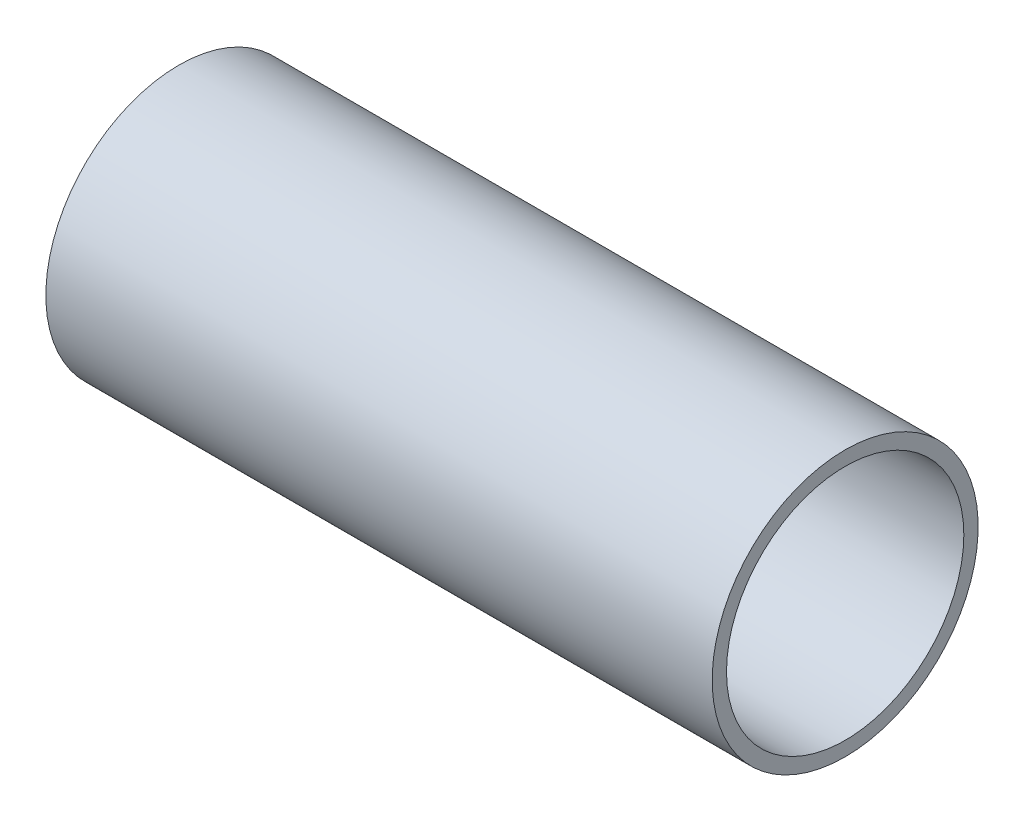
ISO-10303-21;
HEADER;
FILE_DESCRIPTION(('STEP AP214'),'2;1');
FILE_NAME('part.step','',(''),(''),'','','');
FILE_SCHEMA(('AUTOMOTIVE_DESIGN { 1 0 10303 214 1 1 1 1 }'));
ENDSEC;
DATA;
#1=APPLICATION_CONTEXT('core data for automotive mechanical design processes');
#2=APPLICATION_PROTOCOL_DEFINITION('international standard','automotive_design',2000,#1);
#3=PRODUCT_CONTEXT('',#1,'mechanical');
#4=PRODUCT('Part','Part','',(#3));
#5=PRODUCT_RELATED_PRODUCT_CATEGORY('part','',(#4));
#6=PRODUCT_DEFINITION_FORMATION('','',#4);
#7=PRODUCT_DEFINITION_CONTEXT('part definition',#1,'design');
#8=PRODUCT_DEFINITION('design','',#6,#7);
#9=PRODUCT_DEFINITION_SHAPE('','',#8);
#10=(LENGTH_UNIT() NAMED_UNIT(*) SI_UNIT(.MILLI.,.METRE.));
#11=(NAMED_UNIT(*) PLANE_ANGLE_UNIT() SI_UNIT($,.RADIAN.));
#12=(NAMED_UNIT(*) SI_UNIT($,.STERADIAN.) SOLID_ANGLE_UNIT());
#13=UNCERTAINTY_MEASURE_WITH_UNIT(LENGTH_MEASURE(1.E-05),#10,'distance_accuracy_value','');
#14=(GEOMETRIC_REPRESENTATION_CONTEXT(3) GLOBAL_UNCERTAINTY_ASSIGNED_CONTEXT((#13)) GLOBAL_UNIT_ASSIGNED_CONTEXT((#10,
#11,#12)) REPRESENTATION_CONTEXT('',''));
#15=CARTESIAN_POINT('',(0.,0.,0.));
#16=DIRECTION('',(0.,0.,1.));
#17=DIRECTION('',(1.,0.,0.));
#18=AXIS2_PLACEMENT_3D('',#15,#16,#17);
#19=CARTESIAN_POINT('',(678.,-415.,0.));
#20=DIRECTION('',(1.,0.,0.));
#21=DIRECTION('',(0.,1.,0.));
#22=AXIS2_PLACEMENT_3D('',#19,#20,#21);
#23=PLANE('',#22);
#24=CARTESIAN_POINT('',(678.,-415.,0.));
#25=DIRECTION('',(1.,0.,0.));
#26=DIRECTION('',(0.,1.,0.));
#27=AXIS2_PLACEMENT_3D('',#24,#25,#26);
#28=CIRCLE('',#27,24.15);
#29=CARTESIAN_POINT('',(678.,-390.85,0.));
#30=VERTEX_POINT('',#29);
#31=EDGE_CURVE('E13',#30,#30,#28,.T.);
#32=ORIENTED_EDGE('',*,*,#31,.T.);
#33=EDGE_LOOP('',(#32));
#34=FACE_BOUND('',#33,.T.);
#35=CARTESIAN_POINT('',(678.,-415.,0.));
#36=DIRECTION('',(1.,0.,0.));
#37=DIRECTION('',(0.,0.,-1.));
#38=AXIS2_PLACEMENT_3D('',#35,#36,#37);
#39=CIRCLE('',#38,21.55);
#40=CARTESIAN_POINT('',(678.,-415.,-21.55));
#41=VERTEX_POINT('',#40);
#42=EDGE_CURVE('E57',#41,#41,#39,.T.);
#43=ORIENTED_EDGE('',*,*,#42,.F.);
#44=EDGE_LOOP('',(#43));
#45=FACE_BOUND('',#44,.T.);
#46=ADVANCED_FACE('F46',(#34,#45),#23,.T.);
#47=CARTESIAN_POINT('',(557.,-415.,0.));
#48=DIRECTION('',(1.,0.,0.));
#49=DIRECTION('',(0.,1.,0.));
#50=AXIS2_PLACEMENT_3D('',#47,#48,#49);
#51=PLANE('',#50);
#52=CARTESIAN_POINT('',(557.,-415.,0.));
#53=DIRECTION('',(1.,0.,0.));
#54=DIRECTION('',(0.,1.,0.));
#55=AXIS2_PLACEMENT_3D('',#52,#53,#54);
#56=CIRCLE('',#55,24.15);
#57=CARTESIAN_POINT('',(557.,-390.85,0.));
#58=VERTEX_POINT('',#57);
#59=EDGE_CURVE('E50',#58,#58,#56,.T.);
#60=ORIENTED_EDGE('',*,*,#59,.F.);
#61=EDGE_LOOP('',(#60));
#62=FACE_BOUND('',#61,.T.);
#63=CARTESIAN_POINT('',(557.,-415.,0.));
#64=DIRECTION('',(1.,0.,0.));
#65=DIRECTION('',(0.,0.,-1.));
#66=AXIS2_PLACEMENT_3D('',#63,#64,#65);
#67=CIRCLE('',#66,21.55);
#68=CARTESIAN_POINT('',(557.,-415.,-21.55));
#69=VERTEX_POINT('',#68);
#70=EDGE_CURVE('E59',#69,#69,#67,.T.);
#71=ORIENTED_EDGE('',*,*,#70,.T.);
#72=EDGE_LOOP('',(#71));
#73=FACE_BOUND('',#72,.T.);
#74=ADVANCED_FACE('F69',(#62,#73),#51,.F.);
#75=CARTESIAN_POINT('',(678.,-415.,0.));
#76=DIRECTION('',(-1.,0.,0.));
#77=DIRECTION('',(0.,-1.,0.));
#78=AXIS2_PLACEMENT_3D('',#75,#76,#77);
#79=CYLINDRICAL_SURFACE('',#78,24.15);
#80=ORIENTED_EDGE('',*,*,#31,.F.);
#81=EDGE_LOOP('',(#80));
#82=FACE_BOUND('',#81,.T.);
#83=ORIENTED_EDGE('',*,*,#59,.T.);
#84=EDGE_LOOP('',(#83));
#85=FACE_BOUND('',#84,.T.);
#86=ADVANCED_FACE('F48',(#82,#85),#79,.T.);
#87=CARTESIAN_POINT('',(678.,-415.,0.));
#88=DIRECTION('',(-1.,0.,0.));
#89=DIRECTION('',(0.,-1.,0.));
#90=AXIS2_PLACEMENT_3D('',#87,#88,#89);
#91=CYLINDRICAL_SURFACE('',#90,21.55);
#92=ORIENTED_EDGE('',*,*,#42,.T.);
#93=EDGE_LOOP('',(#92));
#94=FACE_BOUND('',#93,.T.);
#95=ORIENTED_EDGE('',*,*,#70,.F.);
#96=EDGE_LOOP('',(#95));
#97=FACE_BOUND('',#96,.T.);
#98=ADVANCED_FACE('F65',(#94,#97),#91,.F.);
#99=CLOSED_SHELL('',(#46,#74,#86,#98));
#100=MANIFOLD_SOLID_BREP('B2',#99);
#101=ADVANCED_BREP_SHAPE_REPRESENTATION('',(#18,#100),#14);
#102=SHAPE_DEFINITION_REPRESENTATION(#9,#101);
ENDSEC;
END-ISO-10303-21;
